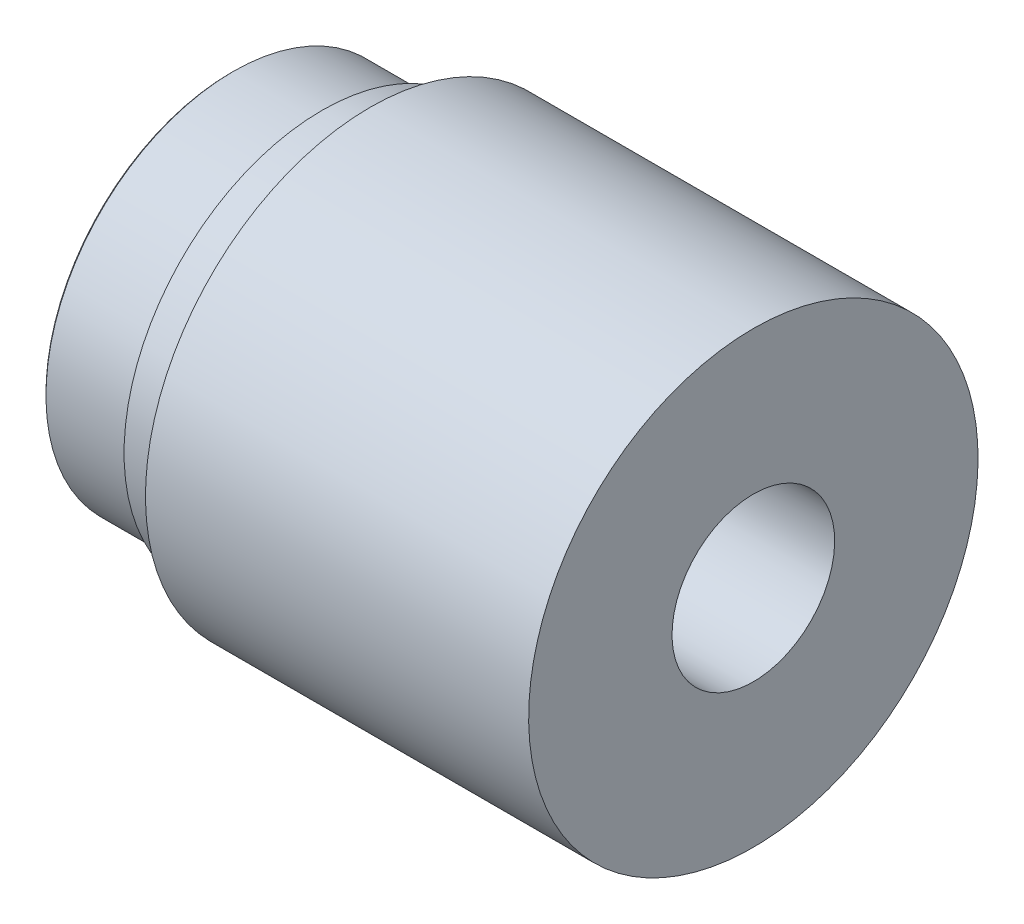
from build123d import *

# Parameters (mm, degrees)
ESQUISSE2_R             = 7.6
ENL_V_MAT_EXTRU_1_DEPTH = 123.27262749


with BuildPart() as part:
    # Esquisse1 → R_volution1 (revolve)
    with BuildSketch(Plane.XY):
        Polygon((-58.159994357, 89.123210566), (-58.159997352, 106.423210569), (-57.959997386, 106.623210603), (-49.659997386, 106.623210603), (-49.659997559, 107.62321204), (-45.159997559, 107.62321204), (-45.159997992, 110.123212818), (-9.349411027, 110.123212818), (-9.349411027, 89.123210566), align=None)
    revolve(axis=Axis((-9.349411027, 89.123210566, 0), (-1, 0, 0)))

    # Esquisse2 → Enl_v. mat.-Extru.1 (cut, through all)
    with BuildSketch(Plane(origin=(-9.349411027, 0, 0), x_dir=(0, 0, -1), z_dir=(1, 0, 0))):
        with Locations(Location((0, 89.123210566, 0), (0, 0, 90))):
            Circle(ESQUISSE2_R)
    extrude(amount=-ENL_V_MAT_EXTRU_1_DEPTH, mode=Mode.SUBTRACT)


solid = part.part
